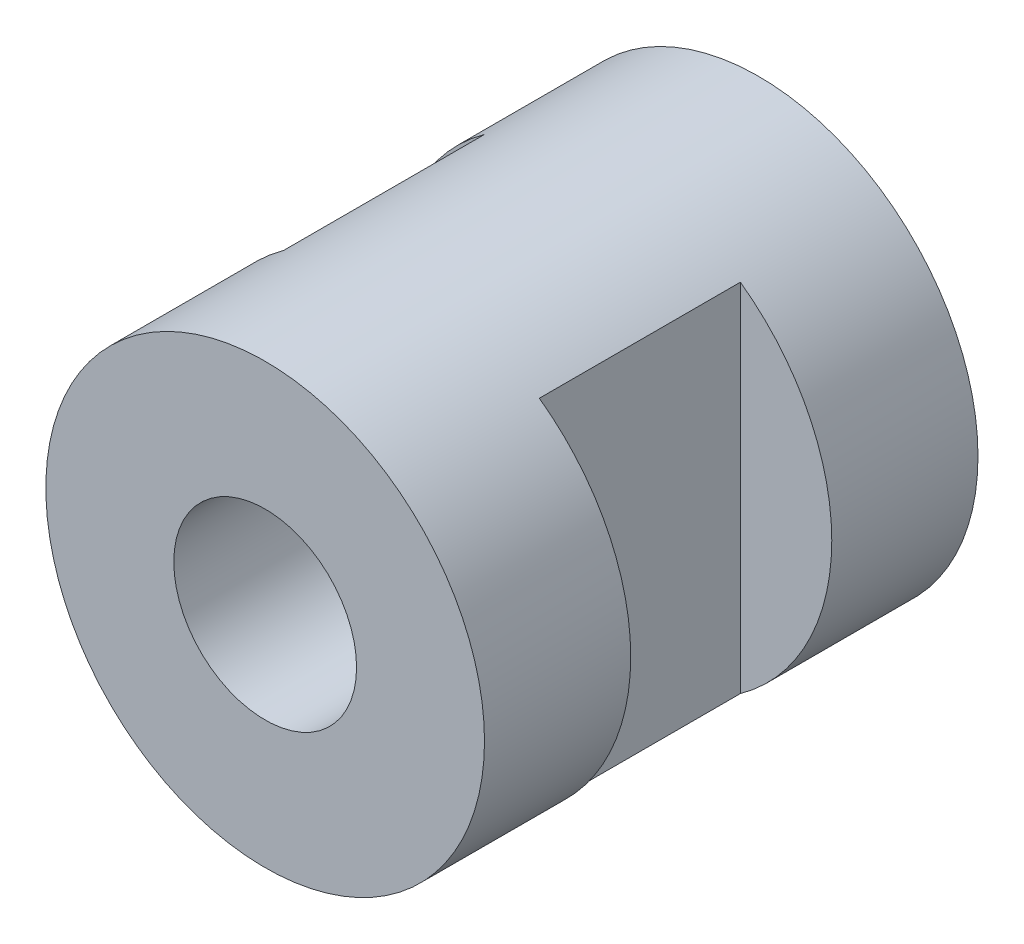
ISO-10303-21;
HEADER;
FILE_DESCRIPTION(('STEP AP214'),'2;1');
FILE_NAME('part.step','',(''),(''),'','','');
FILE_SCHEMA(('AUTOMOTIVE_DESIGN { 1 0 10303 214 1 1 1 1 }'));
ENDSEC;
DATA;
#1=APPLICATION_CONTEXT('core data for automotive mechanical design processes');
#2=APPLICATION_PROTOCOL_DEFINITION('international standard','automotive_design',2000,#1);
#3=PRODUCT_CONTEXT('',#1,'mechanical');
#4=PRODUCT('Part','Part','',(#3));
#5=PRODUCT_RELATED_PRODUCT_CATEGORY('part','',(#4));
#6=PRODUCT_DEFINITION_FORMATION('','',#4);
#7=PRODUCT_DEFINITION_CONTEXT('part definition',#1,'design');
#8=PRODUCT_DEFINITION('design','',#6,#7);
#9=PRODUCT_DEFINITION_SHAPE('','',#8);
#10=(LENGTH_UNIT() NAMED_UNIT(*) SI_UNIT(.MILLI.,.METRE.));
#11=(NAMED_UNIT(*) PLANE_ANGLE_UNIT() SI_UNIT($,.RADIAN.));
#12=(NAMED_UNIT(*) SI_UNIT($,.STERADIAN.) SOLID_ANGLE_UNIT());
#13=UNCERTAINTY_MEASURE_WITH_UNIT(LENGTH_MEASURE(1.E-05),#10,'distance_accuracy_value','');
#14=(GEOMETRIC_REPRESENTATION_CONTEXT(3) GLOBAL_UNCERTAINTY_ASSIGNED_CONTEXT((#13)) GLOBAL_UNIT_ASSIGNED_CONTEXT((#10,
#11,#12)) REPRESENTATION_CONTEXT('',''));
#15=CARTESIAN_POINT('',(0.,0.,0.));
#16=DIRECTION('',(0.,0.,1.));
#17=DIRECTION('',(1.,0.,0.));
#18=AXIS2_PLACEMENT_3D('',#15,#16,#17);
#19=CARTESIAN_POINT('',(0.,0.,13.5));
#20=DIRECTION('',(0.,0.,-1.));
#21=DIRECTION('',(-1.,0.,0.));
#22=AXIS2_PLACEMENT_3D('',#19,#20,#21);
#23=CYLINDRICAL_SURFACE('',#22,6.);
#24=CARTESIAN_POINT('',(0.,0.,9.5));
#25=DIRECTION('',(0.,0.,1.));
#26=DIRECTION('',(1.,0.,0.));
#27=AXIS2_PLACEMENT_3D('',#24,#25,#26);
#28=CIRCLE('',#27,6.);
#29=CARTESIAN_POINT('',(-3.5,4.87339717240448,9.5));
#30=VERTEX_POINT('',#29);
#31=CARTESIAN_POINT('',(-3.5,-4.87339717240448,9.5));
#32=VERTEX_POINT('',#31);
#33=EDGE_CURVE('E39',#30,#32,#28,.T.);
#34=ORIENTED_EDGE('',*,*,#33,.T.);
#35=DIRECTION('',(0.,0.,-1.));
#36=VECTOR('',#35,1.);
#37=CARTESIAN_POINT('',(-3.5,-4.87339717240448,13.5));
#38=LINE('',#37,#36);
#39=CARTESIAN_POINT('',(-3.5,-4.87339717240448,4.));
#40=VERTEX_POINT('',#39);
#41=EDGE_CURVE('E11',#32,#40,#38,.T.);
#42=ORIENTED_EDGE('',*,*,#41,.T.);
#43=CARTESIAN_POINT('',(0.,0.,4.));
#44=DIRECTION('',(0.,0.,-1.));
#45=DIRECTION('',(-1.,0.,0.));
#46=AXIS2_PLACEMENT_3D('',#43,#44,#45);
#47=CIRCLE('',#46,6.);
#48=CARTESIAN_POINT('',(-3.5,4.87339717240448,4.));
#49=VERTEX_POINT('',#48);
#50=EDGE_CURVE('E83',#40,#49,#47,.T.);
#51=ORIENTED_EDGE('',*,*,#50,.T.);
#52=DIRECTION('',(0.,0.,-1.));
#53=VECTOR('',#52,1.);
#54=CARTESIAN_POINT('',(-3.5,4.87339717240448,13.5));
#55=LINE('',#54,#53);
#56=EDGE_CURVE('E82',#49,#30,#55,.F.);
#57=ORIENTED_EDGE('',*,*,#56,.T.);
#58=EDGE_LOOP('',(#34,#42,#51,#57));
#59=FACE_BOUND('',#58,.T.);
#60=DIRECTION('',(0.,0.,-1.));
#61=VECTOR('',#60,1.);
#62=CARTESIAN_POINT('',(3.5,-4.87339717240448,13.5));
#63=LINE('',#62,#61);
#64=CARTESIAN_POINT('',(3.5,-4.87339717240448,4.));
#65=VERTEX_POINT('',#64);
#66=CARTESIAN_POINT('',(3.5,-4.87339717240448,9.5));
#67=VERTEX_POINT('',#66);
#68=EDGE_CURVE('E93',#65,#67,#63,.F.);
#69=ORIENTED_EDGE('',*,*,#68,.T.);
#70=CARTESIAN_POINT('',(0.,0.,9.5));
#71=DIRECTION('',(0.,0.,1.));
#72=DIRECTION('',(1.,0.,0.));
#73=AXIS2_PLACEMENT_3D('',#70,#71,#72);
#74=CIRCLE('',#73,6.);
#75=CARTESIAN_POINT('',(3.5,4.87339717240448,9.5));
#76=VERTEX_POINT('',#75);
#77=EDGE_CURVE('E87',#67,#76,#74,.T.);
#78=ORIENTED_EDGE('',*,*,#77,.T.);
#79=DIRECTION('',(0.,0.,-1.));
#80=VECTOR('',#79,1.);
#81=CARTESIAN_POINT('',(3.5,4.87339717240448,13.5));
#82=LINE('',#81,#80);
#83=CARTESIAN_POINT('',(3.5,4.87339717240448,4.));
#84=VERTEX_POINT('',#83);
#85=EDGE_CURVE('E90',#76,#84,#82,.T.);
#86=ORIENTED_EDGE('',*,*,#85,.T.);
#87=CARTESIAN_POINT('',(0.,0.,4.));
#88=DIRECTION('',(0.,0.,-1.));
#89=DIRECTION('',(-1.,0.,0.));
#90=AXIS2_PLACEMENT_3D('',#87,#88,#89);
#91=CIRCLE('',#90,6.);
#92=EDGE_CURVE('E96',#84,#65,#91,.T.);
#93=ORIENTED_EDGE('',*,*,#92,.T.);
#94=EDGE_LOOP('',(#69,#78,#86,#93));
#95=FACE_BOUND('',#94,.T.);
#96=CARTESIAN_POINT('',(0.,0.,13.5));
#97=DIRECTION('',(0.,0.,1.));
#98=DIRECTION('',(1.,0.,0.));
#99=AXIS2_PLACEMENT_3D('',#96,#97,#98);
#100=CIRCLE('',#99,6.);
#101=CARTESIAN_POINT('',(6.,0.,13.5));
#102=VERTEX_POINT('',#101);
#103=EDGE_CURVE('E99',#102,#102,#100,.T.);
#104=ORIENTED_EDGE('',*,*,#103,.F.);
#105=EDGE_LOOP('',(#104));
#106=FACE_BOUND('',#105,.T.);
#107=CARTESIAN_POINT('',(0.,0.,0.));
#108=DIRECTION('',(0.,0.,1.));
#109=DIRECTION('',(1.,0.,0.));
#110=AXIS2_PLACEMENT_3D('',#107,#108,#109);
#111=CIRCLE('',#110,6.);
#112=CARTESIAN_POINT('',(6.,0.,0.));
#113=VERTEX_POINT('',#112);
#114=EDGE_CURVE('E100',#113,#113,#111,.T.);
#115=ORIENTED_EDGE('',*,*,#114,.T.);
#116=EDGE_LOOP('',(#115));
#117=FACE_BOUND('',#116,.T.);
#118=ADVANCED_FACE('F32',(#59,#95,#106,#117),#23,.T.);
#119=CARTESIAN_POINT('',(0.,0.,13.5));
#120=DIRECTION('',(0.,0.,1.));
#121=DIRECTION('',(1.,0.,0.));
#122=AXIS2_PLACEMENT_3D('',#119,#120,#121);
#123=PLANE('',#122);
#124=CARTESIAN_POINT('',(0.,0.,13.5));
#125=DIRECTION('',(0.,0.,-1.));
#126=DIRECTION('',(-1.,0.,0.));
#127=AXIS2_PLACEMENT_3D('',#124,#125,#126);
#128=CIRCLE('',#127,2.5);
#129=CARTESIAN_POINT('',(-2.5,0.,13.5));
#130=VERTEX_POINT('',#129);
#131=EDGE_CURVE('E79',#130,#130,#128,.T.);
#132=ORIENTED_EDGE('',*,*,#131,.T.);
#133=EDGE_LOOP('',(#132));
#134=FACE_BOUND('',#133,.T.);
#135=ORIENTED_EDGE('',*,*,#103,.T.);
#136=EDGE_LOOP('',(#135));
#137=FACE_BOUND('',#136,.T.);
#138=ADVANCED_FACE('F116',(#134,#137),#123,.T.);
#139=CARTESIAN_POINT('',(0.,0.,0.));
#140=DIRECTION('',(0.,0.,1.));
#141=DIRECTION('',(1.,0.,0.));
#142=AXIS2_PLACEMENT_3D('',#139,#140,#141);
#143=PLANE('',#142);
#144=CARTESIAN_POINT('',(0.,0.,0.));
#145=DIRECTION('',(0.,0.,-1.));
#146=DIRECTION('',(-1.,0.,0.));
#147=AXIS2_PLACEMENT_3D('',#144,#145,#146);
#148=CIRCLE('',#147,2.5);
#149=CARTESIAN_POINT('',(-2.5,0.,0.));
#150=VERTEX_POINT('',#149);
#151=EDGE_CURVE('E110',#150,#150,#148,.T.);
#152=ORIENTED_EDGE('',*,*,#151,.F.);
#153=EDGE_LOOP('',(#152));
#154=FACE_BOUND('',#153,.T.);
#155=ORIENTED_EDGE('',*,*,#114,.F.);
#156=EDGE_LOOP('',(#155));
#157=FACE_BOUND('',#156,.T.);
#158=ADVANCED_FACE('F125',(#154,#157),#143,.F.);
#159=CARTESIAN_POINT('',(7.7864138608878,-6.,9.5));
#160=DIRECTION('',(0.,0.,1.));
#161=DIRECTION('',(1.,0.,0.));
#162=AXIS2_PLACEMENT_3D('',#159,#160,#161);
#163=PLANE('',#162);
#164=DIRECTION('',(0.,1.,0.));
#165=VECTOR('',#164,1.);
#166=CARTESIAN_POINT('',(3.5,-6.,9.5));
#167=LINE('',#166,#165);
#168=EDGE_CURVE('E103',#67,#76,#167,.T.);
#169=ORIENTED_EDGE('',*,*,#168,.T.);
#170=ORIENTED_EDGE('',*,*,#77,.F.);
#171=EDGE_LOOP('',(#169,#170));
#172=FACE_BOUND('',#171,.T.);
#173=ADVANCED_FACE('F128',(#172),#163,.F.);
#174=CARTESIAN_POINT('',(3.5,-6.,9.5));
#175=DIRECTION('',(-1.,0.,0.));
#176=DIRECTION('',(0.,0.,1.));
#177=AXIS2_PLACEMENT_3D('',#174,#175,#176);
#178=PLANE('',#177);
#179=ORIENTED_EDGE('',*,*,#168,.F.);
#180=ORIENTED_EDGE('',*,*,#68,.F.);
#181=DIRECTION('',(0.,1.,0.));
#182=VECTOR('',#181,1.);
#183=CARTESIAN_POINT('',(3.5,-6.,4.));
#184=LINE('',#183,#182);
#185=EDGE_CURVE('E53',#65,#84,#184,.T.);
#186=ORIENTED_EDGE('',*,*,#185,.T.);
#187=ORIENTED_EDGE('',*,*,#85,.F.);
#188=EDGE_LOOP('',(#179,#180,#186,#187));
#189=FACE_BOUND('',#188,.T.);
#190=ADVANCED_FACE('F142',(#189),#178,.F.);
#191=CARTESIAN_POINT('',(7.7864138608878,-6.,4.));
#192=DIRECTION('',(0.,0.,-1.));
#193=DIRECTION('',(-1.,0.,0.));
#194=AXIS2_PLACEMENT_3D('',#191,#192,#193);
#195=PLANE('',#194);
#196=ORIENTED_EDGE('',*,*,#185,.F.);
#197=ORIENTED_EDGE('',*,*,#92,.F.);
#198=EDGE_LOOP('',(#196,#197));
#199=FACE_BOUND('',#198,.T.);
#200=ADVANCED_FACE('F139',(#199),#195,.F.);
#201=CARTESIAN_POINT('',(-7.7864138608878,-6.,9.5));
#202=DIRECTION('',(0.,0.,1.));
#203=DIRECTION('',(1.,0.,0.));
#204=AXIS2_PLACEMENT_3D('',#201,#202,#203);
#205=PLANE('',#204);
#206=DIRECTION('',(0.,1.,0.));
#207=VECTOR('',#206,1.);
#208=CARTESIAN_POINT('',(-3.5,-6.,9.5));
#209=LINE('',#208,#207);
#210=EDGE_CURVE('E46',#32,#30,#209,.T.);
#211=ORIENTED_EDGE('',*,*,#210,.F.);
#212=ORIENTED_EDGE('',*,*,#33,.F.);
#213=EDGE_LOOP('',(#211,#212));
#214=FACE_BOUND('',#213,.T.);
#215=ADVANCED_FACE('F77',(#214),#205,.F.);
#216=CARTESIAN_POINT('',(-7.7864138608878,-6.,4.));
#217=DIRECTION('',(0.,0.,-1.));
#218=DIRECTION('',(-1.,0.,0.));
#219=AXIS2_PLACEMENT_3D('',#216,#217,#218);
#220=PLANE('',#219);
#221=DIRECTION('',(0.,1.,0.));
#222=VECTOR('',#221,1.);
#223=CARTESIAN_POINT('',(-3.5,-6.,4.));
#224=LINE('',#223,#222);
#225=EDGE_CURVE('E72',#40,#49,#224,.T.);
#226=ORIENTED_EDGE('',*,*,#225,.T.);
#227=ORIENTED_EDGE('',*,*,#50,.F.);
#228=EDGE_LOOP('',(#226,#227));
#229=FACE_BOUND('',#228,.T.);
#230=ADVANCED_FACE('F151',(#229),#220,.F.);
#231=CARTESIAN_POINT('',(-3.5,-6.,9.5));
#232=DIRECTION('',(1.,0.,0.));
#233=DIRECTION('',(0.,0.,-1.));
#234=AXIS2_PLACEMENT_3D('',#231,#232,#233);
#235=PLANE('',#234);
#236=ORIENTED_EDGE('',*,*,#210,.T.);
#237=ORIENTED_EDGE('',*,*,#56,.F.);
#238=ORIENTED_EDGE('',*,*,#225,.F.);
#239=ORIENTED_EDGE('',*,*,#41,.F.);
#240=EDGE_LOOP('',(#236,#237,#238,#239));
#241=FACE_BOUND('',#240,.T.);
#242=ADVANCED_FACE('F70',(#241),#235,.F.);
#243=CARTESIAN_POINT('',(0.,0.,13.5));
#244=DIRECTION('',(0.,0.,-1.));
#245=DIRECTION('',(-1.,0.,0.));
#246=AXIS2_PLACEMENT_3D('',#243,#244,#245);
#247=CYLINDRICAL_SURFACE('',#246,2.5);
#248=ORIENTED_EDGE('',*,*,#131,.F.);
#249=EDGE_LOOP('',(#248));
#250=FACE_BOUND('',#249,.T.);
#251=ORIENTED_EDGE('',*,*,#151,.T.);
#252=EDGE_LOOP('',(#251));
#253=FACE_BOUND('',#252,.T.);
#254=ADVANCED_FACE('F119',(#250,#253),#247,.F.);
#255=CLOSED_SHELL('',(#118,#138,#158,#173,#190,#200,#215,#230,#242,#254));
#256=MANIFOLD_SOLID_BREP('B2',#255);
#257=ADVANCED_BREP_SHAPE_REPRESENTATION('',(#18,#256),#14);
#258=SHAPE_DEFINITION_REPRESENTATION(#9,#257);
ENDSEC;
END-ISO-10303-21;
